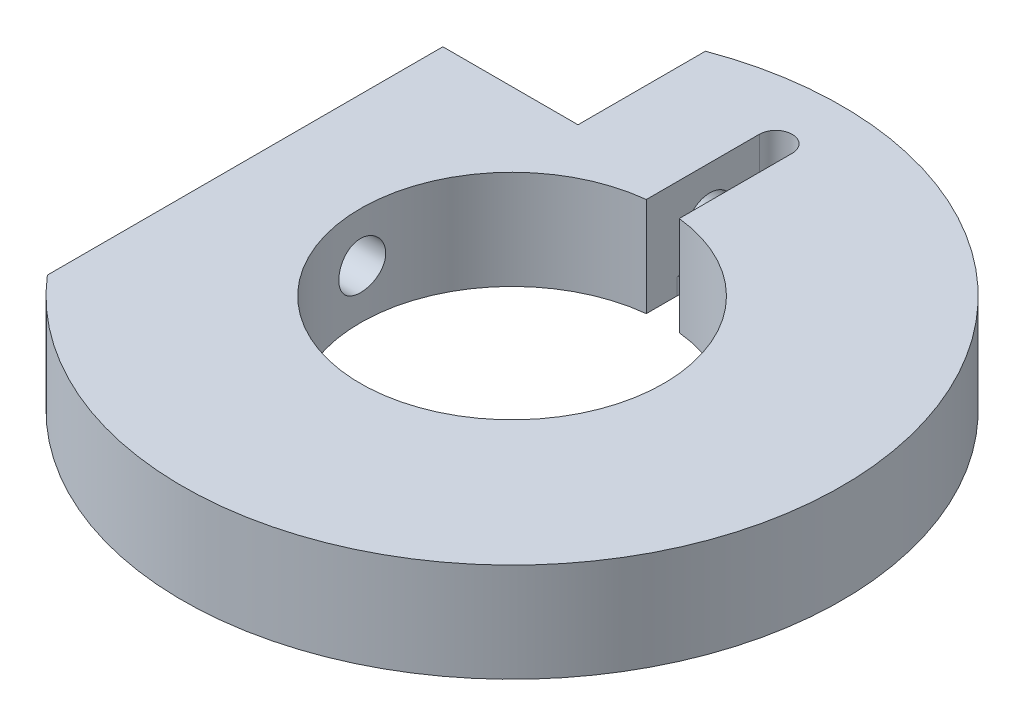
ISO-10303-21;
HEADER;
FILE_DESCRIPTION(('STEP AP214'),'2;1');
FILE_NAME('part.step','',(''),(''),'','','');
FILE_SCHEMA(('AUTOMOTIVE_DESIGN { 1 0 10303 214 1 1 1 1 }'));
ENDSEC;
DATA;
#1=APPLICATION_CONTEXT('core data for automotive mechanical design processes');
#2=APPLICATION_PROTOCOL_DEFINITION('international standard','automotive_design',2000,#1);
#3=PRODUCT_CONTEXT('',#1,'mechanical');
#4=PRODUCT('Part','Part','',(#3));
#5=PRODUCT_RELATED_PRODUCT_CATEGORY('part','',(#4));
#6=PRODUCT_DEFINITION_FORMATION('','',#4);
#7=PRODUCT_DEFINITION_CONTEXT('part definition',#1,'design');
#8=PRODUCT_DEFINITION('design','',#6,#7);
#9=PRODUCT_DEFINITION_SHAPE('','',#8);
#10=(LENGTH_UNIT() NAMED_UNIT(*) SI_UNIT(.MILLI.,.METRE.));
#11=(NAMED_UNIT(*) PLANE_ANGLE_UNIT() SI_UNIT($,.RADIAN.));
#12=(NAMED_UNIT(*) SI_UNIT($,.STERADIAN.) SOLID_ANGLE_UNIT());
#13=UNCERTAINTY_MEASURE_WITH_UNIT(LENGTH_MEASURE(1.E-05),#10,'distance_accuracy_value','');
#14=(GEOMETRIC_REPRESENTATION_CONTEXT(3) GLOBAL_UNCERTAINTY_ASSIGNED_CONTEXT((#13)) GLOBAL_UNIT_ASSIGNED_CONTEXT((#10,
#11,#12)) REPRESENTATION_CONTEXT('',''));
#15=CARTESIAN_POINT('',(0.,0.,0.));
#16=DIRECTION('',(0.,0.,1.));
#17=DIRECTION('',(1.,0.,0.));
#18=AXIS2_PLACEMENT_3D('',#15,#16,#17);
#19=CARTESIAN_POINT('',(0.,0.79375,-12.7));
#20=DIRECTION('',(0.,1.,0.));
#21=DIRECTION('',(0.,0.,1.));
#22=AXIS2_PLACEMENT_3D('',#19,#20,#21);
#23=PLANE('',#22);
#24=DIRECTION('',(0.,0.,-1.));
#25=VECTOR('',#24,1.);
#26=CARTESIAN_POINT('',(-0.793750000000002,0.793749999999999,-5.06095));
#27=LINE('',#26,#25);
#28=CARTESIAN_POINT('',(-0.793750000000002,0.793749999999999,-12.5993970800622));
#29=VERTEX_POINT('',#28);
#30=CARTESIAN_POINT('',(-0.793750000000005,0.793749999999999,-12.7));
#31=VERTEX_POINT('',#30);
#32=EDGE_CURVE('E175',#29,#31,#27,.T.);
#33=ORIENTED_EDGE('',*,*,#32,.F.);
#34=CARTESIAN_POINT('',(0.,0.79375,-12.7));
#35=DIRECTION('',(0.,1.,0.));
#36=DIRECTION('',(0.,0.,1.));
#37=AXIS2_PLACEMENT_3D('',#34,#35,#36);
#38=CIRCLE('',#37,0.800100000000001);
#39=CARTESIAN_POINT('',(0.793750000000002,0.793749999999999,-12.5993970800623));
#40=VERTEX_POINT('',#39);
#41=EDGE_CURVE('E194',#40,#29,#38,.T.);
#42=ORIENTED_EDGE('',*,*,#41,.F.);
#43=DIRECTION('',(0.,0.,1.));
#44=VECTOR('',#43,1.);
#45=CARTESIAN_POINT('',(0.793750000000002,0.793749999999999,-5.06095));
#46=LINE('',#45,#44);
#47=CARTESIAN_POINT('',(0.79375,0.793749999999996,-12.7));
#48=VERTEX_POINT('',#47);
#49=EDGE_CURVE('E189',#48,#40,#46,.T.);
#50=ORIENTED_EDGE('',*,*,#49,.F.);
#51=CARTESIAN_POINT('',(0.,0.793749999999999,-12.7));
#52=DIRECTION('',(0.,1.,0.));
#53=DIRECTION('',(0.,0.,1.));
#54=AXIS2_PLACEMENT_3D('',#51,#52,#53);
#55=CIRCLE('',#54,0.793750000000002);
#56=EDGE_CURVE('E172',#31,#48,#55,.F.);
#57=ORIENTED_EDGE('',*,*,#56,.F.);
#58=EDGE_LOOP('',(#33,#42,#50,#57));
#59=FACE_BOUND('',#58,.T.);
#60=ADVANCED_FACE('F40',(#59),#23,.F.);
#61=CARTESIAN_POINT('',(0.,0.,0.));
#62=DIRECTION('',(0.,1.,0.));
#63=DIRECTION('',(0.,0.,1.));
#64=AXIS2_PLACEMENT_3D('',#61,#62,#63);
#65=PLANE('',#64);
#66=CARTESIAN_POINT('',(0.,0.,0.));
#67=DIRECTION('',(0.,-1.,0.));
#68=DIRECTION('',(0.,0.,-1.));
#69=AXIS2_PLACEMENT_3D('',#66,#67,#68);
#70=CIRCLE('',#69,7.3025);
#71=CARTESIAN_POINT('',(0.793750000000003,0.,-7.25923323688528));
#72=VERTEX_POINT('',#71);
#73=CARTESIAN_POINT('',(-0.793750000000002,0.,-7.25923323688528));
#74=VERTEX_POINT('',#73);
#75=EDGE_CURVE('E197',#72,#74,#70,.T.);
#76=ORIENTED_EDGE('',*,*,#75,.F.);
#77=DIRECTION('',(0.,0.,-1.));
#78=VECTOR('',#77,1.);
#79=CARTESIAN_POINT('',(0.793750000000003,0.,-8.73125));
#80=LINE('',#79,#78);
#81=CARTESIAN_POINT('',(0.793750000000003,0.,-8.73125));
#82=VERTEX_POINT('',#81);
#83=EDGE_CURVE('E157',#72,#82,#80,.T.);
#84=ORIENTED_EDGE('',*,*,#83,.T.);
#85=CARTESIAN_POINT('',(0.,0.,-8.73125));
#86=DIRECTION('',(0.,1.,0.));
#87=DIRECTION('',(0.,0.,1.));
#88=AXIS2_PLACEMENT_3D('',#85,#86,#87);
#89=CIRCLE('',#88,0.793750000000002);
#90=CARTESIAN_POINT('',(-0.793750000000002,0.,-8.73125));
#91=VERTEX_POINT('',#90);
#92=EDGE_CURVE('E161',#82,#91,#89,.T.);
#93=ORIENTED_EDGE('',*,*,#92,.T.);
#94=DIRECTION('',(0.,0.,1.));
#95=VECTOR('',#94,1.);
#96=CARTESIAN_POINT('',(-0.793750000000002,0.,-8.73125));
#97=LINE('',#96,#95);
#98=EDGE_CURVE('E164',#91,#74,#97,.T.);
#99=ORIENTED_EDGE('',*,*,#98,.T.);
#100=EDGE_LOOP('',(#76,#84,#93,#99));
#101=FACE_BOUND('',#100,.T.);
#102=DIRECTION('',(-1.,0.,0.));
#103=VECTOR('',#102,1.);
#104=CARTESIAN_POINT('',(-5.55625,0.,-8.73125));
#105=LINE('',#104,#103);
#106=CARTESIAN_POINT('',(-5.55625,0.,-8.73125));
#107=VERTEX_POINT('',#106);
#108=CARTESIAN_POINT('',(-12.065,0.,-8.73125));
#109=VERTEX_POINT('',#108);
#110=EDGE_CURVE('E148',#107,#109,#105,.T.);
#111=ORIENTED_EDGE('',*,*,#110,.F.);
#112=DIRECTION('',(0.,0.,1.));
#113=VECTOR('',#112,1.);
#114=CARTESIAN_POINT('',(-5.55625,0.,-8.73125));
#115=LINE('',#114,#113);
#116=CARTESIAN_POINT('',(-5.55625,0.,-14.8709014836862));
#117=VERTEX_POINT('',#116);
#118=EDGE_CURVE('E128',#117,#107,#115,.T.);
#119=ORIENTED_EDGE('',*,*,#118,.F.);
#120=CARTESIAN_POINT('',(0.,0.,0.));
#121=DIRECTION('',(0.,1.,0.));
#122=DIRECTION('',(0.,0.,1.));
#123=AXIS2_PLACEMENT_3D('',#120,#121,#122);
#124=CIRCLE('',#123,15.875);
#125=CARTESIAN_POINT('',(-12.065,0.,10.3175287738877));
#126=VERTEX_POINT('',#125);
#127=EDGE_CURVE('E204',#126,#117,#124,.T.);
#128=ORIENTED_EDGE('',*,*,#127,.F.);
#129=DIRECTION('',(0.,0.,1.));
#130=VECTOR('',#129,1.);
#131=CARTESIAN_POINT('',(-12.065,0.,-8.73125));
#132=LINE('',#131,#130);
#133=EDGE_CURVE('E55',#109,#126,#132,.T.);
#134=ORIENTED_EDGE('',*,*,#133,.F.);
#135=EDGE_LOOP('',(#111,#119,#128,#134));
#136=FACE_BOUND('',#135,.T.);
#137=CARTESIAN_POINT('',(0.,0.,-12.7));
#138=DIRECTION('',(0.,1.,0.));
#139=DIRECTION('',(0.,0.,1.));
#140=AXIS2_PLACEMENT_3D('',#137,#138,#139);
#141=CIRCLE('',#140,0.800100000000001);
#142=CARTESIAN_POINT('',(0.,0.,-11.8999));
#143=VERTEX_POINT('',#142);
#144=EDGE_CURVE('E198',#143,#143,#141,.T.);
#145=ORIENTED_EDGE('',*,*,#144,.T.);
#146=EDGE_LOOP('',(#145));
#147=FACE_BOUND('',#146,.T.);
#148=ADVANCED_FACE('F219',(#101,#136,#147),#65,.F.);
#149=CARTESIAN_POINT('',(0.,4.7625,0.));
#150=DIRECTION('',(0.,1.,0.));
#151=DIRECTION('',(0.,0.,1.));
#152=AXIS2_PLACEMENT_3D('',#149,#150,#151);
#153=PLANE('',#152);
#154=DIRECTION('',(0.,0.,1.));
#155=VECTOR('',#154,1.);
#156=CARTESIAN_POINT('',(-5.55625,4.7625,-8.73125));
#157=LINE('',#156,#155);
#158=CARTESIAN_POINT('',(-5.55625,4.7625,-14.8709014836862));
#159=VERTEX_POINT('',#158);
#160=CARTESIAN_POINT('',(-5.55625,4.7625,-8.73125));
#161=VERTEX_POINT('',#160);
#162=EDGE_CURVE('E126',#159,#161,#157,.T.);
#163=ORIENTED_EDGE('',*,*,#162,.T.);
#164=DIRECTION('',(-1.,0.,0.));
#165=VECTOR('',#164,1.);
#166=CARTESIAN_POINT('',(-5.55625,4.7625,-8.73125));
#167=LINE('',#166,#165);
#168=CARTESIAN_POINT('',(-12.065,4.7625,-8.73125));
#169=VERTEX_POINT('',#168);
#170=EDGE_CURVE('E136',#161,#169,#167,.T.);
#171=ORIENTED_EDGE('',*,*,#170,.T.);
#172=DIRECTION('',(0.,0.,1.));
#173=VECTOR('',#172,1.);
#174=CARTESIAN_POINT('',(-12.065,4.7625,-8.73125));
#175=LINE('',#174,#173);
#176=CARTESIAN_POINT('',(-12.065,4.7625,10.3175287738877));
#177=VERTEX_POINT('',#176);
#178=EDGE_CURVE('E133',#169,#177,#175,.T.);
#179=ORIENTED_EDGE('',*,*,#178,.T.);
#180=CARTESIAN_POINT('',(0.,4.7625,0.));
#181=DIRECTION('',(0.,1.,0.));
#182=DIRECTION('',(0.,0.,1.));
#183=AXIS2_PLACEMENT_3D('',#180,#181,#182);
#184=CIRCLE('',#183,15.875);
#185=EDGE_CURVE('E146',#177,#159,#184,.T.);
#186=ORIENTED_EDGE('',*,*,#185,.T.);
#187=EDGE_LOOP('',(#163,#171,#179,#186));
#188=FACE_BOUND('',#187,.T.);
#189=DIRECTION('',(0.,0.,1.));
#190=VECTOR('',#189,1.);
#191=CARTESIAN_POINT('',(-0.793750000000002,4.7625,-5.06095));
#192=LINE('',#191,#190);
#193=CARTESIAN_POINT('',(-0.793750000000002,4.7625,-12.7));
#194=VERTEX_POINT('',#193);
#195=CARTESIAN_POINT('',(-0.793750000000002,4.7625,-7.25923323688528));
#196=VERTEX_POINT('',#195);
#197=EDGE_CURVE('E183',#194,#196,#192,.T.);
#198=ORIENTED_EDGE('',*,*,#197,.F.);
#199=CARTESIAN_POINT('',(0.,4.7625,-12.7));
#200=DIRECTION('',(0.,1.,0.));
#201=DIRECTION('',(0.,0.,1.));
#202=AXIS2_PLACEMENT_3D('',#199,#200,#201);
#203=CIRCLE('',#202,0.793750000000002);
#204=CARTESIAN_POINT('',(0.79375,4.7625,-12.7));
#205=VERTEX_POINT('',#204);
#206=EDGE_CURVE('E180',#205,#194,#203,.T.);
#207=ORIENTED_EDGE('',*,*,#206,.F.);
#208=DIRECTION('',(0.,0.,-1.));
#209=VECTOR('',#208,1.);
#210=CARTESIAN_POINT('',(0.793750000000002,4.7625,-5.06095));
#211=LINE('',#210,#209);
#212=CARTESIAN_POINT('',(0.793750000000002,4.7625,-7.25923323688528));
#213=VERTEX_POINT('',#212);
#214=EDGE_CURVE('E170',#213,#205,#211,.T.);
#215=ORIENTED_EDGE('',*,*,#214,.F.);
#216=CARTESIAN_POINT('',(0.,4.7625,0.));
#217=DIRECTION('',(0.,-1.,0.));
#218=DIRECTION('',(0.,0.,-1.));
#219=AXIS2_PLACEMENT_3D('',#216,#217,#218);
#220=CIRCLE('',#219,7.3025);
#221=EDGE_CURVE('E201',#213,#196,#220,.T.);
#222=ORIENTED_EDGE('',*,*,#221,.T.);
#223=EDGE_LOOP('',(#198,#207,#215,#222));
#224=FACE_BOUND('',#223,.T.);
#225=ADVANCED_FACE('F143',(#188,#224),#153,.T.);
#226=CARTESIAN_POINT('',(0.,4.7625,0.));
#227=DIRECTION('',(0.,-1.,0.));
#228=DIRECTION('',(0.,0.,-1.));
#229=AXIS2_PLACEMENT_3D('',#226,#227,#228);
#230=CYLINDRICAL_SURFACE('',#229,15.875);
#231=ORIENTED_EDGE('',*,*,#127,.T.);
#232=DIRECTION('',(0.,-1.,0.));
#233=VECTOR('',#232,1.);
#234=CARTESIAN_POINT('',(-5.55625,4.7625,-14.8709014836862));
#235=LINE('',#234,#233);
#236=EDGE_CURVE('E12',#117,#159,#235,.F.);
#237=ORIENTED_EDGE('',*,*,#236,.T.);
#238=ORIENTED_EDGE('',*,*,#185,.F.);
#239=DIRECTION('',(0.,-1.,0.));
#240=VECTOR('',#239,1.);
#241=CARTESIAN_POINT('',(-12.065,4.7625,10.3175287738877));
#242=LINE('',#241,#240);
#243=EDGE_CURVE('E48',#177,#126,#242,.T.);
#244=ORIENTED_EDGE('',*,*,#243,.T.);
#245=EDGE_LOOP('',(#231,#237,#238,#244));
#246=FACE_BOUND('',#245,.T.);
#247=ADVANCED_FACE('F42',(#246),#230,.T.);
#248=CARTESIAN_POINT('',(0.,4.7625,0.));
#249=DIRECTION('',(0.,-1.,0.));
#250=DIRECTION('',(0.,0.,-1.));
#251=AXIS2_PLACEMENT_3D('',#248,#249,#250);
#252=CYLINDRICAL_SURFACE('',#251,7.3025);
#253=CARTESIAN_POINT('',(-7.2144943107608,2.38125,1.13029999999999));
#254=CARTESIAN_POINT('',(-7.21449539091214,2.44433009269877,1.13029741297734));
#255=CARTESIAN_POINT('',(-7.21533058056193,2.50744620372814,1.12500154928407));
#256=CARTESIAN_POINT('',(-7.21857861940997,2.63191203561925,1.10396463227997));
#257=CARTESIAN_POINT('',(-7.22099298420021,2.69326000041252,1.08821354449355));
#258=CARTESIAN_POINT('',(-7.22711951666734,2.81237000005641,1.04675019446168));
#259=CARTESIAN_POINT('',(-7.23083066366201,2.87013481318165,1.02104576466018));
#260=CARTESIAN_POINT('',(-7.23913139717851,2.98052390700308,0.960424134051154));
#261=CARTESIAN_POINT('',(-7.24372086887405,3.0331488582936,0.925508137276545));
#262=CARTESIAN_POINT('',(-7.25330483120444,3.13222024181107,0.847137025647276));
#263=CARTESIAN_POINT('',(-7.25830214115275,3.1786165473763,0.80361888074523));
#264=CARTESIAN_POINT('',(-7.26811357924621,3.26347895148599,0.709414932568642));
#265=CARTESIAN_POINT('',(-7.27292769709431,3.30194460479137,0.658728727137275));
#266=CARTESIAN_POINT('',(-7.28185992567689,3.37003966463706,0.551305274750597));
#267=CARTESIAN_POINT('',(-7.28597434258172,3.39962277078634,0.494538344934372));
#268=CARTESIAN_POINT('',(-7.29301231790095,3.44881572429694,0.376766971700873));
#269=CARTESIAN_POINT('',(-7.29593594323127,3.46842613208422,0.315762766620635));
#270=CARTESIAN_POINT('',(-7.30024302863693,3.49696467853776,0.191765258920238));
#271=CARTESIAN_POINT('',(-7.30163859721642,3.50597684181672,0.128791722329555));
#272=CARTESIAN_POINT('',(-7.30277385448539,3.51332408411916,0.00221186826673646));
#273=CARTESIAN_POINT('',(-7.30251364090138,3.51165979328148,-0.061394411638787));
#274=CARTESIAN_POINT('',(-7.30037630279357,3.49776746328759,-0.186860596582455));
#275=CARTESIAN_POINT('',(-7.29851301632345,3.48562982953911,-0.248730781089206));
#276=CARTESIAN_POINT('',(-7.29339430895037,3.45127738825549,-0.369545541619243));
#277=CARTESIAN_POINT('',(-7.29013885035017,3.42906230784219,-0.4284900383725));
#278=CARTESIAN_POINT('',(-7.28257785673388,3.37509377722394,-0.542052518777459));
#279=CARTESIAN_POINT('',(-7.27826816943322,3.34330249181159,-0.5966522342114));
#280=CARTESIAN_POINT('',(-7.26907861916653,3.2711116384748,-0.699776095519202));
#281=CARTESIAN_POINT('',(-7.26419871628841,3.23071146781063,-0.748299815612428));
#282=CARTESIAN_POINT('',(-7.25435223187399,3.14194663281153,-0.838427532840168));
#283=CARTESIAN_POINT('',(-7.24938527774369,3.09350301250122,-0.879953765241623));
#284=CARTESIAN_POINT('',(-7.23997421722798,2.99029405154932,-0.954299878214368));
#285=CARTESIAN_POINT('',(-7.23553011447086,2.93552866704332,-0.987119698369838));
#286=CARTESIAN_POINT('',(-7.22766795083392,2.82114718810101,-1.04313317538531));
#287=CARTESIAN_POINT('',(-7.2242507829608,2.76152692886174,-1.06631846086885));
#288=CARTESIAN_POINT('',(-7.21884489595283,2.63917377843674,-1.10232448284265));
#289=CARTESIAN_POINT('',(-7.21685606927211,2.57644112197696,-1.11514599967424));
#290=CARTESIAN_POINT('',(-7.2145525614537,2.45033689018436,-1.12995308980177));
#291=CARTESIAN_POINT('',(-7.21422082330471,2.38697857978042,-1.13204907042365));
#292=CARTESIAN_POINT('',(-7.21522372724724,2.260815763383,-1.1256389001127));
#293=CARTESIAN_POINT('',(-7.21655831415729,2.19801123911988,-1.11713310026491));
#294=CARTESIAN_POINT('',(-7.22072780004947,2.07508322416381,-1.08985459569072));
#295=CARTESIAN_POINT('',(-7.22355461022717,2.01494715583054,-1.07113722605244));
#296=CARTESIAN_POINT('',(-7.23038332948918,1.89866573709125,-1.02402459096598));
#297=CARTESIAN_POINT('',(-7.234385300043,1.84252059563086,-0.995628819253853));
#298=CARTESIAN_POINT('',(-7.24315345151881,1.73532084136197,-0.929701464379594));
#299=CARTESIAN_POINT('',(-7.24792549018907,1.68431054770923,-0.892098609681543));
#300=CARTESIAN_POINT('',(-7.25767858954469,1.58928479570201,-0.808923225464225));
#301=CARTESIAN_POINT('',(-7.26265966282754,1.54526975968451,-0.763350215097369));
#302=CARTESIAN_POINT('',(-7.27232307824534,1.46508559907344,-0.665041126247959));
#303=CARTESIAN_POINT('',(-7.27700236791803,1.42898977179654,-0.612244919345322));
#304=CARTESIAN_POINT('',(-7.28548713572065,1.36618008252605,-0.501274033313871));
#305=CARTESIAN_POINT('',(-7.28929263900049,1.33946595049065,-0.443099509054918));
#306=CARTESIAN_POINT('',(-7.29558771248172,1.29629424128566,-0.323249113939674));
#307=CARTESIAN_POINT('',(-7.29808235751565,1.27979706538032,-0.261587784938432));
#308=CARTESIAN_POINT('',(-7.30149598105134,1.25739957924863,-0.13632845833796));
#309=CARTESIAN_POINT('',(-7.30241507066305,1.2514985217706,-0.0727305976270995));
#310=CARTESIAN_POINT('',(-7.30257278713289,1.25047992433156,0.0538865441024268));
#311=CARTESIAN_POINT('',(-7.30182886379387,1.25525040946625,0.116904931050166));
#312=CARTESIAN_POINT('',(-7.29877944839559,1.27519886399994,0.241231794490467));
#313=CARTESIAN_POINT('',(-7.29647396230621,1.29037679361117,0.302540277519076));
#314=CARTESIAN_POINT('',(-7.29055932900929,1.33066865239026,0.421672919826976));
#315=CARTESIAN_POINT('',(-7.2869512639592,1.35577433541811,0.479499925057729));
#316=CARTESIAN_POINT('',(-7.27882709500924,1.41519696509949,0.590138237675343));
#317=CARTESIAN_POINT('',(-7.27431095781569,1.44951424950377,0.642949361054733));
#318=CARTESIAN_POINT('',(-7.26481599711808,1.52678866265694,0.742623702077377));
#319=CARTESIAN_POINT('',(-7.25983302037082,1.5698282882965,0.789422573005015));
#320=CARTESIAN_POINT('',(-7.24999616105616,1.66315210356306,0.87517411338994));
#321=CARTESIAN_POINT('',(-7.24514230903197,1.71343798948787,0.914124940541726));
#322=CARTESIAN_POINT('',(-7.23608191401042,1.82018348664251,0.983286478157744));
#323=CARTESIAN_POINT('',(-7.231879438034,1.8766783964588,1.01344323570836));
#324=CARTESIAN_POINT('',(-7.22464538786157,1.99397105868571,1.06379410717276));
#325=CARTESIAN_POINT('',(-7.22161261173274,2.05476431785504,1.08399845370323));
#326=CARTESIAN_POINT('',(-7.21775430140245,2.16005905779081,1.10933993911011));
#327=CARTESIAN_POINT('',(-7.21653837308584,2.20391357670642,1.11718777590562));
#328=CARTESIAN_POINT('',(-7.21490800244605,2.29225609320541,1.12766868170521));
#329=CARTESIAN_POINT('',(-7.21449354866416,2.33674408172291,1.13030182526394));
#330=CARTESIAN_POINT('',(-7.2144943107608,2.38125,1.13029999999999));
#331=B_SPLINE_CURVE_WITH_KNOTS('',3,(#253,#254,#255,#256,#257,#258,#259,#260,#261,#262,#263,
#264,#265,#266,#267,#268,#269,#270,#271,#272,#273,#274,#275,#276,#277,#278,#279,#280,#281,#282,
#283,#284,#285,#286,#287,#288,#289,#290,#291,#292,#293,#294,#295,#296,#297,#298,#299,#300,#301,
#302,#303,#304,#305,#306,#307,#308,#309,#310,#311,#312,#313,#314,#315,#316,#317,#318,#319,#320,
#321,#322,#323,#324,#325,#326,#327,#328,#329,#330),.UNSPECIFIED.,.T.,.F.,(4,2,2,2,2,2,2,2,2,2,2,
2,2,2,2,2,2,2,2,2,2,2,2,2,2,2,2,2,2,2,2,2,2,2,2,2,2,2,4),(0.,0.189077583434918,
0.378336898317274,0.567447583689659,0.756533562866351,0.947060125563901,1.13759738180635,
1.32911123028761,1.52061431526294,1.71058867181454,1.9005518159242,2.08889142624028,
2.27723613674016,2.46633497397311,2.65544705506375,2.84653904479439,3.03763236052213,
3.228891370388,3.4201359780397,3.60940791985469,3.79867359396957,3.98692370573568,
4.17518366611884,4.36494975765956,4.55472730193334,4.74619347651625,4.93765413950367,
5.12836802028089,5.31906845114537,5.50777728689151,5.69648540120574,5.88503709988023,
6.07359571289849,6.26402877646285,6.45450649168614,6.64612934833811,6.83755477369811,
6.97095964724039,7.10436261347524),.UNSPECIFIED.);
#332=CARTESIAN_POINT('',(-7.2144943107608,2.38125,1.13029999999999));
#333=VERTEX_POINT('',#332);
#334=EDGE_CURVE('E279',#333,#333,#331,.T.);
#335=ORIENTED_EDGE('',*,*,#334,.T.);
#336=EDGE_LOOP('',(#335));
#337=FACE_BOUND('',#336,.T.);
#338=DIRECTION('',(0.,-1.,0.));
#339=VECTOR('',#338,1.);
#340=CARTESIAN_POINT('',(0.793750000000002,4.7625,-7.25923323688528));
#341=LINE('',#340,#339);
#342=EDGE_CURVE('E208',#213,#72,#341,.T.);
#343=ORIENTED_EDGE('',*,*,#342,.T.);
#344=ORIENTED_EDGE('',*,*,#75,.T.);
#345=DIRECTION('',(0.,-1.,0.));
#346=VECTOR('',#345,1.);
#347=CARTESIAN_POINT('',(-0.793750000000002,4.7625,-7.25923323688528));
#348=LINE('',#347,#346);
#349=EDGE_CURVE('E212',#74,#196,#348,.F.);
#350=ORIENTED_EDGE('',*,*,#349,.T.);
#351=ORIENTED_EDGE('',*,*,#221,.F.);
#352=EDGE_LOOP('',(#343,#344,#350,#351));
#353=FACE_BOUND('',#352,.T.);
#354=ADVANCED_FACE('F228',(#337,#353),#252,.F.);
#355=CARTESIAN_POINT('',(0.,0.79375,-12.7));
#356=DIRECTION('',(0.,-1.,0.));
#357=DIRECTION('',(0.,0.,-1.));
#358=AXIS2_PLACEMENT_3D('',#355,#356,#357);
#359=CYLINDRICAL_SURFACE('',#358,0.800100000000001);
#360=ORIENTED_EDGE('',*,*,#41,.T.);
#361=EDGE_CURVE('E192',#29,#40,#38,.T.);
#362=ORIENTED_EDGE('',*,*,#361,.T.);
#363=EDGE_LOOP('',(#360,#362));
#364=FACE_BOUND('',#363,.T.);
#365=ORIENTED_EDGE('',*,*,#144,.F.);
#366=EDGE_LOOP('',(#365));
#367=FACE_BOUND('',#366,.T.);
#368=ADVANCED_FACE('F225',(#364,#367),#359,.F.);
#369=CARTESIAN_POINT('',(-0.793750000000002,-9.36212482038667,-5.06095));
#370=DIRECTION('',(-1.,0.,0.));
#371=DIRECTION('',(0.,0.,1.));
#372=AXIS2_PLACEMENT_3D('',#369,#370,#371);
#373=PLANE('',#372);
#374=CARTESIAN_POINT('',(-0.793750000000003,2.38125,-10.31875));
#375=DIRECTION('',(-1.,0.,0.));
#376=DIRECTION('',(0.,0.,1.));
#377=AXIS2_PLACEMENT_3D('',#374,#375,#376);
#378=CIRCLE('',#377,1.1303);
#379=CARTESIAN_POINT('',(-0.793750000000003,2.38125,-9.18845));
#380=VERTEX_POINT('',#379);
#381=EDGE_CURVE('E151',#380,#380,#378,.T.);
#382=ORIENTED_EDGE('',*,*,#381,.T.);
#383=EDGE_LOOP('',(#382));
#384=FACE_BOUND('',#383,.T.);
#385=ORIENTED_EDGE('',*,*,#349,.F.);
#386=ORIENTED_EDGE('',*,*,#98,.F.);
#387=DIRECTION('',(0.,1.,0.));
#388=VECTOR('',#387,1.);
#389=CARTESIAN_POINT('',(-0.793750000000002,0.,-8.73125));
#390=LINE('',#389,#388);
#391=CARTESIAN_POINT('',(-0.793750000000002,0.79375,-8.73125));
#392=VERTEX_POINT('',#391);
#393=EDGE_CURVE('E167',#91,#392,#390,.T.);
#394=ORIENTED_EDGE('',*,*,#393,.T.);
#395=EDGE_CURVE('E178',#392,#29,#27,.T.);
#396=ORIENTED_EDGE('',*,*,#395,.T.);
#397=ORIENTED_EDGE('',*,*,#32,.T.);
#398=DIRECTION('',(0.,1.,0.));
#399=VECTOR('',#398,1.);
#400=CARTESIAN_POINT('',(-0.793750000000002,-9.36212482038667,-12.7));
#401=LINE('',#400,#399);
#402=EDGE_CURVE('E176',#31,#194,#401,.T.);
#403=ORIENTED_EDGE('',*,*,#402,.T.);
#404=ORIENTED_EDGE('',*,*,#197,.T.);
#405=EDGE_LOOP('',(#385,#386,#394,#396,#397,#403,#404));
#406=FACE_BOUND('',#405,.T.);
#407=ADVANCED_FACE('F227',(#384,#406),#373,.F.);
#408=CARTESIAN_POINT('',(0.793750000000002,-9.36212482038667,-5.06095));
#409=DIRECTION('',(1.,0.,0.));
#410=DIRECTION('',(0.,0.,-1.));
#411=AXIS2_PLACEMENT_3D('',#408,#409,#410);
#412=PLANE('',#411);
#413=CARTESIAN_POINT('',(0.793750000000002,0.79375,-8.73125));
#414=VERTEX_POINT('',#413);
#415=EDGE_CURVE('E193',#40,#414,#46,.T.);
#416=ORIENTED_EDGE('',*,*,#415,.T.);
#417=DIRECTION('',(0.,1.,0.));
#418=VECTOR('',#417,1.);
#419=CARTESIAN_POINT('',(0.793750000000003,0.,-8.73125));
#420=LINE('',#419,#418);
#421=EDGE_CURVE('E63',#82,#414,#420,.T.);
#422=ORIENTED_EDGE('',*,*,#421,.F.);
#423=ORIENTED_EDGE('',*,*,#83,.F.);
#424=ORIENTED_EDGE('',*,*,#342,.F.);
#425=ORIENTED_EDGE('',*,*,#214,.T.);
#426=DIRECTION('',(0.,1.,0.));
#427=VECTOR('',#426,1.);
#428=CARTESIAN_POINT('',(0.79375,-9.36212482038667,-12.7));
#429=LINE('',#428,#427);
#430=EDGE_CURVE('E185',#48,#205,#429,.T.);
#431=ORIENTED_EDGE('',*,*,#430,.F.);
#432=ORIENTED_EDGE('',*,*,#49,.T.);
#433=EDGE_LOOP('',(#416,#422,#423,#424,#425,#431,#432));
#434=FACE_BOUND('',#433,.T.);
#435=ADVANCED_FACE('F235',(#434),#412,.F.);
#436=CARTESIAN_POINT('',(0.,0.79375,0.));
#437=DIRECTION('',(0.,1.,0.));
#438=DIRECTION('',(0.,0.,1.));
#439=AXIS2_PLACEMENT_3D('',#436,#437,#438);
#440=PLANE('',#439);
#441=CARTESIAN_POINT('',(0.,0.79375,-8.73125));
#442=DIRECTION('',(0.,1.,0.));
#443=DIRECTION('',(0.,0.,1.));
#444=AXIS2_PLACEMENT_3D('',#441,#442,#443);
#445=CIRCLE('',#444,0.793750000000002);
#446=EDGE_CURVE('E215',#414,#392,#445,.T.);
#447=ORIENTED_EDGE('',*,*,#446,.F.);
#448=ORIENTED_EDGE('',*,*,#415,.F.);
#449=ORIENTED_EDGE('',*,*,#361,.F.);
#450=ORIENTED_EDGE('',*,*,#395,.F.);
#451=EDGE_LOOP('',(#447,#448,#449,#450));
#452=FACE_BOUND('',#451,.T.);
#453=ADVANCED_FACE('F249',(#452),#440,.T.);
#454=CARTESIAN_POINT('',(0.,-9.36212482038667,-12.7));
#455=DIRECTION('',(0.,1.,0.));
#456=DIRECTION('',(0.,0.,1.));
#457=AXIS2_PLACEMENT_3D('',#454,#455,#456);
#458=CYLINDRICAL_SURFACE('',#457,0.793750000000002);
#459=ORIENTED_EDGE('',*,*,#56,.T.);
#460=ORIENTED_EDGE('',*,*,#430,.T.);
#461=ORIENTED_EDGE('',*,*,#206,.T.);
#462=ORIENTED_EDGE('',*,*,#402,.F.);
#463=EDGE_LOOP('',(#459,#460,#461,#462));
#464=FACE_BOUND('',#463,.T.);
#465=ADVANCED_FACE('F251',(#464),#458,.F.);
#466=CARTESIAN_POINT('',(0.,0.,-8.73125));
#467=DIRECTION('',(0.,1.,0.));
#468=DIRECTION('',(0.,0.,1.));
#469=AXIS2_PLACEMENT_3D('',#466,#467,#468);
#470=CYLINDRICAL_SURFACE('',#469,0.793750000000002);
#471=ORIENTED_EDGE('',*,*,#446,.T.);
#472=ORIENTED_EDGE('',*,*,#393,.F.);
#473=ORIENTED_EDGE('',*,*,#92,.F.);
#474=ORIENTED_EDGE('',*,*,#421,.T.);
#475=EDGE_LOOP('',(#471,#472,#473,#474));
#476=FACE_BOUND('',#475,.T.);
#477=ADVANCED_FACE('F253',(#476),#470,.F.);
#478=CARTESIAN_POINT('',(-5.55625,4.7625,-8.73125));
#479=DIRECTION('',(1.,0.,0.));
#480=DIRECTION('',(0.,0.,-1.));
#481=AXIS2_PLACEMENT_3D('',#478,#479,#480);
#482=PLANE('',#481);
#483=CARTESIAN_POINT('',(-5.55625,2.38125,-10.31875));
#484=DIRECTION('',(-1.,0.,0.));
#485=DIRECTION('',(0.,0.,1.));
#486=AXIS2_PLACEMENT_3D('',#483,#484,#485);
#487=CIRCLE('',#486,1.1303);
#488=CARTESIAN_POINT('',(-5.55625,2.38125,-9.18845));
#489=VERTEX_POINT('',#488);
#490=EDGE_CURVE('E284',#489,#489,#487,.T.);
#491=ORIENTED_EDGE('',*,*,#490,.F.);
#492=EDGE_LOOP('',(#491));
#493=FACE_BOUND('',#492,.T.);
#494=ORIENTED_EDGE('',*,*,#118,.T.);
#495=DIRECTION('',(0.,-1.,0.));
#496=VECTOR('',#495,1.);
#497=CARTESIAN_POINT('',(-5.55625,4.7625,-8.73125));
#498=LINE('',#497,#496);
#499=EDGE_CURVE('E122',#161,#107,#498,.T.);
#500=ORIENTED_EDGE('',*,*,#499,.F.);
#501=ORIENTED_EDGE('',*,*,#162,.F.);
#502=ORIENTED_EDGE('',*,*,#236,.F.);
#503=EDGE_LOOP('',(#494,#500,#501,#502));
#504=FACE_BOUND('',#503,.T.);
#505=ADVANCED_FACE('F124',(#493,#504),#482,.F.);
#506=CARTESIAN_POINT('',(-12.065,4.7625,-8.73125));
#507=DIRECTION('',(1.,0.,0.));
#508=DIRECTION('',(0.,0.,-1.));
#509=AXIS2_PLACEMENT_3D('',#506,#507,#508);
#510=PLANE('',#509);
#511=CARTESIAN_POINT('',(-12.065,2.38125,0.));
#512=DIRECTION('',(-1.,0.,0.));
#513=DIRECTION('',(0.,0.,1.));
#514=AXIS2_PLACEMENT_3D('',#511,#512,#513);
#515=CIRCLE('',#514,1.13029999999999);
#516=CARTESIAN_POINT('',(-12.065,2.38125,1.13029999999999));
#517=VERTEX_POINT('',#516);
#518=EDGE_CURVE('E285',#517,#517,#515,.T.);
#519=ORIENTED_EDGE('',*,*,#518,.F.);
#520=EDGE_LOOP('',(#519));
#521=FACE_BOUND('',#520,.T.);
#522=ORIENTED_EDGE('',*,*,#178,.F.);
#523=DIRECTION('',(0.,-1.,0.));
#524=VECTOR('',#523,1.);
#525=CARTESIAN_POINT('',(-12.065,4.7625,-8.73125));
#526=LINE('',#525,#524);
#527=EDGE_CURVE('E132',#169,#109,#526,.T.);
#528=ORIENTED_EDGE('',*,*,#527,.T.);
#529=ORIENTED_EDGE('',*,*,#133,.T.);
#530=ORIENTED_EDGE('',*,*,#243,.F.);
#531=EDGE_LOOP('',(#522,#528,#529,#530));
#532=FACE_BOUND('',#531,.T.);
#533=ADVANCED_FACE('F263',(#521,#532),#510,.F.);
#534=CARTESIAN_POINT('',(-5.55625,4.7625,-8.73125));
#535=DIRECTION('',(0.,0.,1.));
#536=DIRECTION('',(1.,0.,0.));
#537=AXIS2_PLACEMENT_3D('',#534,#535,#536);
#538=PLANE('',#537);
#539=ORIENTED_EDGE('',*,*,#110,.T.);
#540=ORIENTED_EDGE('',*,*,#527,.F.);
#541=ORIENTED_EDGE('',*,*,#170,.F.);
#542=ORIENTED_EDGE('',*,*,#499,.T.);
#543=EDGE_LOOP('',(#539,#540,#541,#542));
#544=FACE_BOUND('',#543,.T.);
#545=ADVANCED_FACE('F137',(#544),#538,.F.);
#546=CARTESIAN_POINT('',(-5.55625,2.38125,-10.31875));
#547=DIRECTION('',(-1.,0.,0.));
#548=DIRECTION('',(0.,0.,1.));
#549=AXIS2_PLACEMENT_3D('',#546,#547,#548);
#550=CYLINDRICAL_SURFACE('',#549,1.1303);
#551=ORIENTED_EDGE('',*,*,#381,.F.);
#552=EDGE_LOOP('',(#551));
#553=FACE_BOUND('',#552,.T.);
#554=ORIENTED_EDGE('',*,*,#490,.T.);
#555=EDGE_LOOP('',(#554));
#556=FACE_BOUND('',#555,.T.);
#557=ADVANCED_FACE('F267',(#553,#556),#550,.F.);
#558=CARTESIAN_POINT('',(-12.065,2.38125,0.));
#559=DIRECTION('',(-1.,0.,0.));
#560=DIRECTION('',(0.,0.,1.));
#561=AXIS2_PLACEMENT_3D('',#558,#559,#560);
#562=CYLINDRICAL_SURFACE('',#561,1.13029999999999);
#563=ORIENTED_EDGE('',*,*,#334,.F.);
#564=EDGE_LOOP('',(#563));
#565=FACE_BOUND('',#564,.T.);
#566=ORIENTED_EDGE('',*,*,#518,.T.);
#567=EDGE_LOOP('',(#566));
#568=FACE_BOUND('',#567,.T.);
#569=ADVANCED_FACE('F273',(#565,#568),#562,.F.);
#570=CLOSED_SHELL('',(#60,#148,#225,#247,#354,#368,#407,#435,#453,#465,#477,#505,#533,#545,#557,#569));
#571=MANIFOLD_SOLID_BREP('B2',#570);
#572=ADVANCED_BREP_SHAPE_REPRESENTATION('',(#18,#571),#14);
#573=SHAPE_DEFINITION_REPRESENTATION(#9,#572);
ENDSEC;
END-ISO-10303-21;
